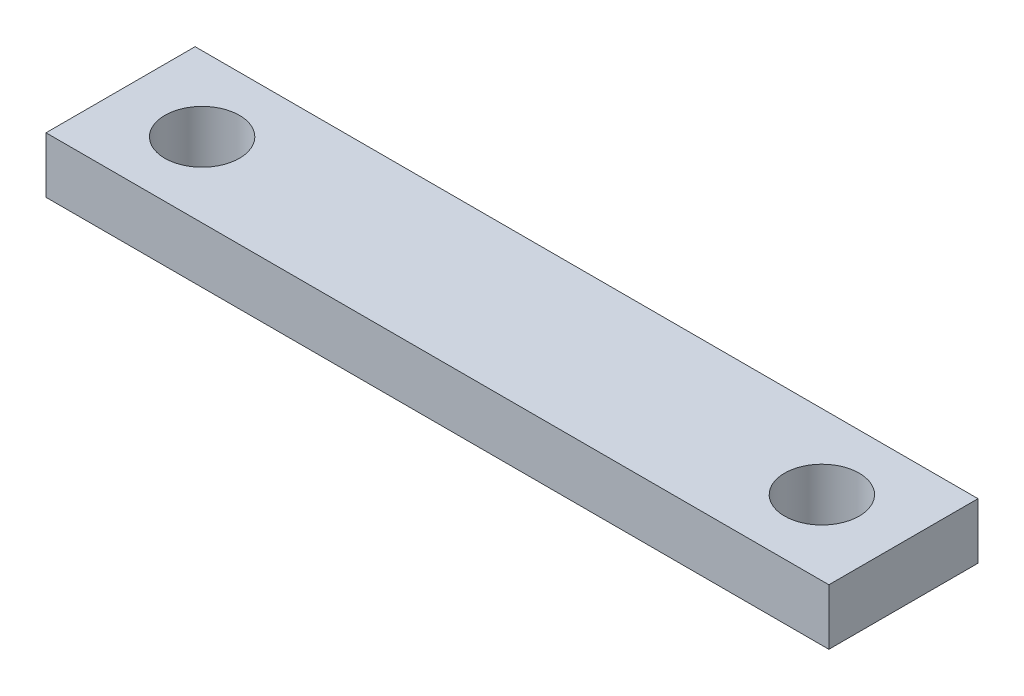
from build123d import *

# Parameters (mm, degrees)
SKETCH1_W           = 133.35
SKETCH1_H           = 25.4
BOSS_EXTRUDE1_DEPTH = 9.525
SKETCH2_R           = 6.35
CUT_EXTRUDE1_DEPTH  = 69.538830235


with BuildPart() as part:
    # Sketch1 → Boss-Extrude1 (new body)
    with BuildSketch(Plane(origin=(0, 0, 0), x_dir=(1, 0, 0), z_dir=(0, 1, 0))):
        Rectangle(SKETCH1_W, SKETCH1_H)
    extrude(amount=BOSS_EXTRUDE1_DEPTH)

    # Sketch2 → Cut-Extrude1 (cut, through all)
    with BuildSketch(Plane(origin=(0, 9.525, 0), x_dir=(1, 0, 0), z_dir=(0, 1, 0))):
        with Locations(Location((52.7812, 0, 0), (0, 0, 270))):
            Circle(SKETCH2_R)
    cut_extrude1 = extrude(amount=-CUT_EXTRUDE1_DEPTH, mode=Mode.SUBTRACT)

    # Mirror1: Cut-Extrude1 across plane
    add(cut_extrude1.mirror(Plane(origin=(0, 0, 0), x_dir=(0, 0, 1), z_dir=(1, 0, 0))), mode=Mode.SUBTRACT)


solid = part.part
